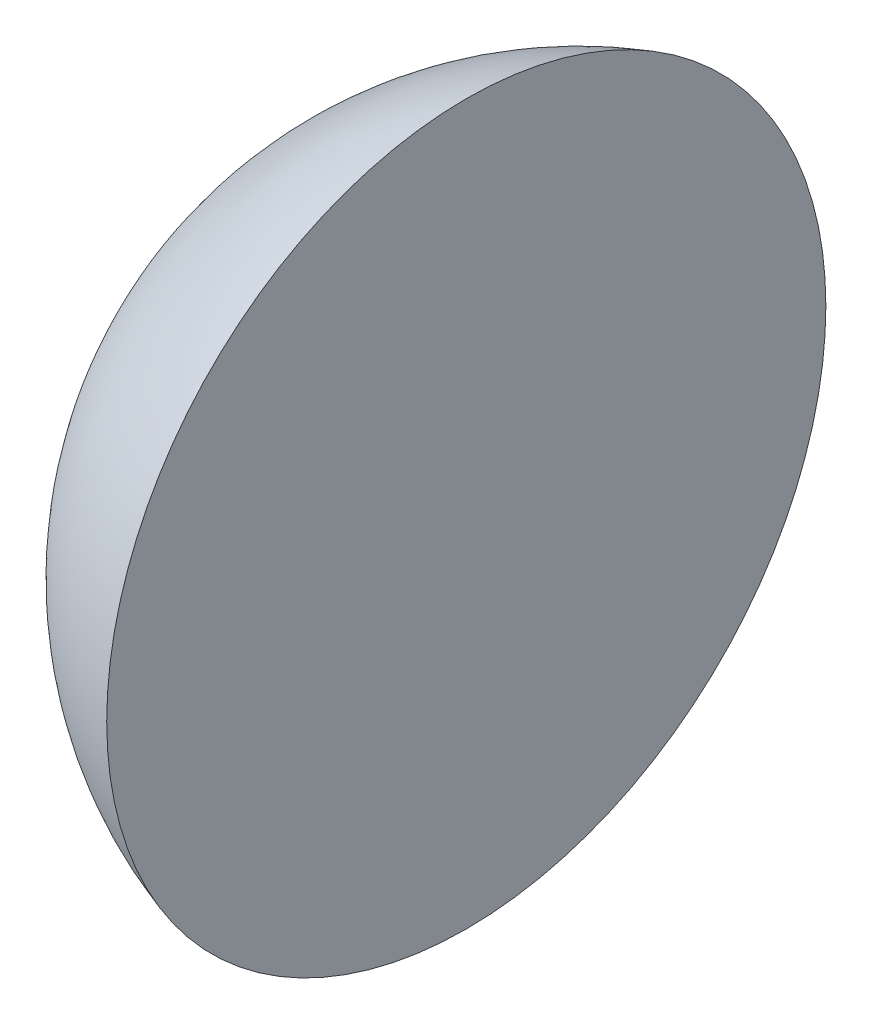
from build123d import *


with BuildPart() as part:
    # Skizze1 → Rotation1 (revolve)
    with BuildSketch(Plane.XY):
        with BuildLine():
            Line((53.544294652, 1.7), (53.544294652, 0))
            Line((53.544294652, 0), (52.295, 0))
            ThreePointArc((52.295, 0), (52.640909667, 1.05483851), (53.544294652, 1.7))
        make_face()
    revolve(axis=Axis((52.295, 0, 0), (1, 0, 0)))


solid = part.part
